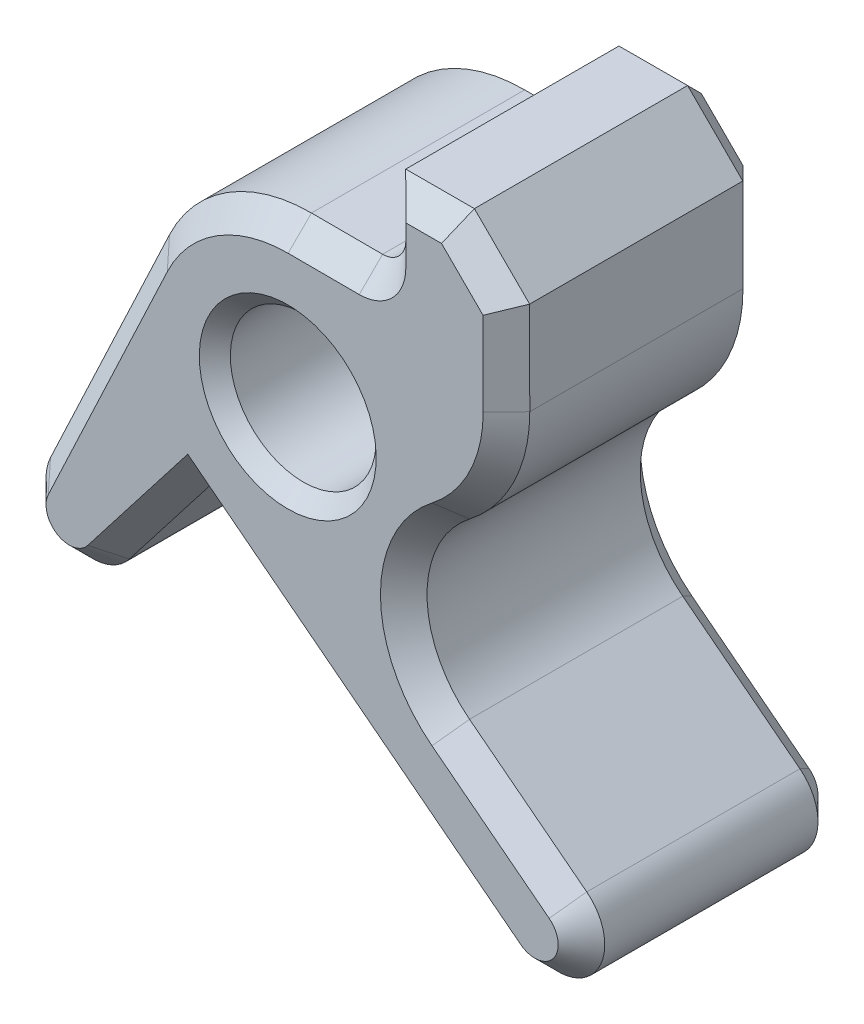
from build123d import *

# Parameters (mm, degrees)
SKETCH3_R             = 2.9825
BOSS_EXTRUDE1_DEPTH   = 5.3126
CHAMFER1_SIZE         = 0.635
BODY_MOVE_COPY1_ANGLE = 90
CHAMFER2_SIZE         = 0.9525


with BuildPart() as part:
    # Sketch3 → Boss-Extrude1 (new, symmetric)
    with BuildSketch(Plane(origin=(0, 0, 0), x_dir=(1, 0, 0), z_dir=(0, 1, 0))):
        with BuildLine():
            Line((3.872834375, -9.881691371), (3.87651894, -7.341694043))
            ThreePointArc((3.87651894, -7.341694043), (3.598274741, -6.669154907), (2.925395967, -6.391733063))
            Line((2.925395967, -6.391733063), (0.017106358, -6.399507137))
            ThreePointArc((0.017106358, -6.399507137), (-3.420144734, -5.408936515), (-5.788783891, -2.728363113))
            Line((-5.788783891, -2.728363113), (-10.657535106, 7.601694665))
            ThreePointArc((-10.657535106, 7.601694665), (-9.930041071, 10.037939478), (-7.428863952, 9.581157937))
            Line((-7.428863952, 9.581157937), (-3.921313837, 5.05739874))
            Line((-3.921313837, 5.05739874), (8.9408, 15.030190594))
            ThreePointArc((8.9408, 15.030190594), (11.613566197, 14.692002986), (11.275378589, 12.01923679))
            Line((11.275378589, 12.01923679), (6.481764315, 8.302451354))
            ThreePointArc((6.481764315, 8.302451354), (4.743623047, 4.754079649), (6.483778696, 1.206695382))
            ThreePointArc((6.483778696, 1.206695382), (8.299095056, -1.022107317), (8.945657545, -3.822980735))
            Line((8.945657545, -3.822980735), (8.940130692, -7.632980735))
            Line((8.940130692, -7.632980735), (6.680801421, -9.885764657))
            Line((6.680801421, -9.885764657), (3.872834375, -9.881691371))
        make_face()
        with Locations(Location((0, 0, 0), (0, 0, 270))):
            Circle(SKETCH3_R, mode=Mode.SUBTRACT)
    extrude(amount=BOSS_EXTRUDE1_DEPTH, both=True)

    # Chamfer1
    chamfer1_edges = [part.edges().sort_by_distance(p)[0] for p in [
        (0, -5.3126, -2.9825),
        (0, 5.3126, -2.9825),
    ]]
    chamfer(chamfer1_edges, length=CHAMFER1_SIZE)


with BuildPart() as part_1:
    # Body-Move_Copy1: moved
    add(part.part.rotate(Axis((0, 0, -2.771974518), (-1, 0, 0)), BODY_MOVE_COPY1_ANGLE))

    # Chamfer2
    chamfer2_edges = [part_1.edges().sort_by_distance(p)[0] for p in [
        (8.942894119, 8.499955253, -8.084574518),
        (8.299095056, 3.794081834, -8.084574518),
        (3.874676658, 11.383667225, 2.540625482),
        (3.598274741, 9.441129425, 2.540625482),
        (1.471251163, 9.167594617, 2.540625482),
        (-3.420144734, 8.180911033, 2.540625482),
        (-8.223159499, 0.335308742, 2.540625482),
        (-9.930041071, -7.26596496, 2.540625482),
        (-5.675088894, -4.547303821, 2.540625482),
        (4.743623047, -1.982105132, -8.084574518),
        (2.509743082, -7.271820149, 2.540625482),
        (11.613566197, -11.920028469, 2.540625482),
        (8.878571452, -7.388869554, 2.540625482),
        (4.743623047, -1.982105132, 2.540625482),
        (8.299095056, 3.794081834, 2.540625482),
        (8.942894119, 8.499955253, 2.540625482),
        (7.810466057, 11.531347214, 2.540625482),
        (5.276817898, 12.655702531, 2.540625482),
        (8.878571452, -7.388869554, -8.084574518),
        (11.613566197, -11.920028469, -8.084574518),
        (2.509743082, -7.271820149, -8.084574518),
        (-5.675088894, -4.547303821, -8.084574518),
        (-9.930041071, -7.26596496, -8.084574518),
        (-8.223159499, 0.335308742, -8.084574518),
        (-3.420144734, 8.180911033, -8.084574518),
        (5.276817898, 12.655702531, -8.084574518),
        (1.471251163, 9.167594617, -8.084574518),
        (3.598274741, 9.441129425, -8.084574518),
        (3.874676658, 11.383667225, -8.084574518),
        (7.810466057, 11.531347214, -8.084574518),
    ]]
    chamfer(chamfer2_edges, length=CHAMFER2_SIZE)


solid = part_1.part
